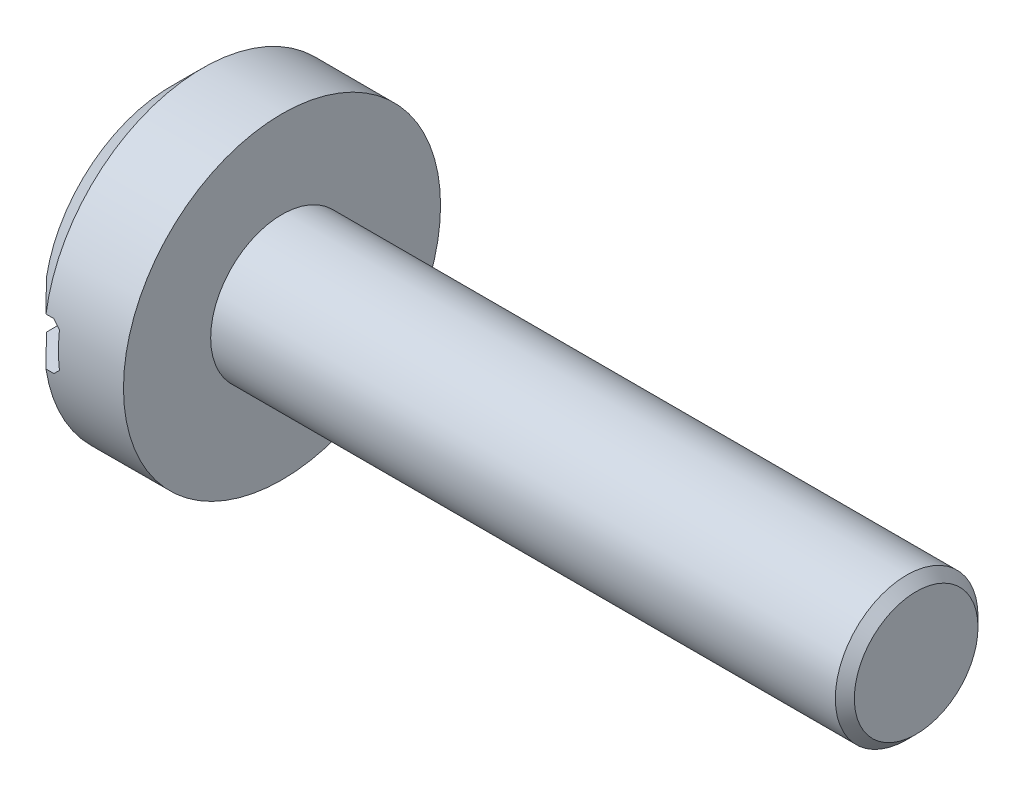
from build123d import *

# Parameters (mm, degrees)
ENL_V_MAT_EXTRU_1_DEPTH = 5
ESQUISSE3_R             = 2.25
EXTRUSION1_DEPTH        = 20
CHANFREIN1_SIZE         = 0.3


with BuildPart() as part:
    # Esquisse1 → R_volution1 (revolve)
    with BuildSketch(Plane.XY, mode=Mode.PRIVATE) as r_volution1_sk:
        Polygon((0, 0), (0, 4), (1, 5), (3.5, 5), (3.5, 0), align=None)
    revolve(r_volution1_sk.sketch.rotate(Axis((0, 0, 0), (1, 0, 0)), 90), axis=Axis((0, 0, 0), (1, 0, 0)))

    # Esquisse2 → Enl_v. mat.-Extru.1 (cut, symmetric)
    with BuildSketch(Plane.XY):
        Polygon((0, 0.75), (1.25, 0.75), (1.45, 0.55), (1.45, -0.55), (1.25, -0.75), (0, -0.75), align=None)
    extrude(amount=ENL_V_MAT_EXTRU_1_DEPTH, both=True, mode=Mode.SUBTRACT)

    # Esquisse3 → Extrusion1 (add)
    with BuildSketch(Plane(origin=(3.5, 0, 0), x_dir=(0, 0, -1), z_dir=(1, 0, 0))):
        with Locations(Location((0, 0, 0), (0, 0, 180))):
            Circle(ESQUISSE3_R)
    extrude(amount=EXTRUSION1_DEPTH)

    # Chanfrein1
    chanfrein1_edges = [part.edges().sort_by_distance(p)[0] for p in [
        (23.5, 0, -2.25),
    ]]
    chamfer(chanfrein1_edges, length=CHANFREIN1_SIZE)


solid = part.part
